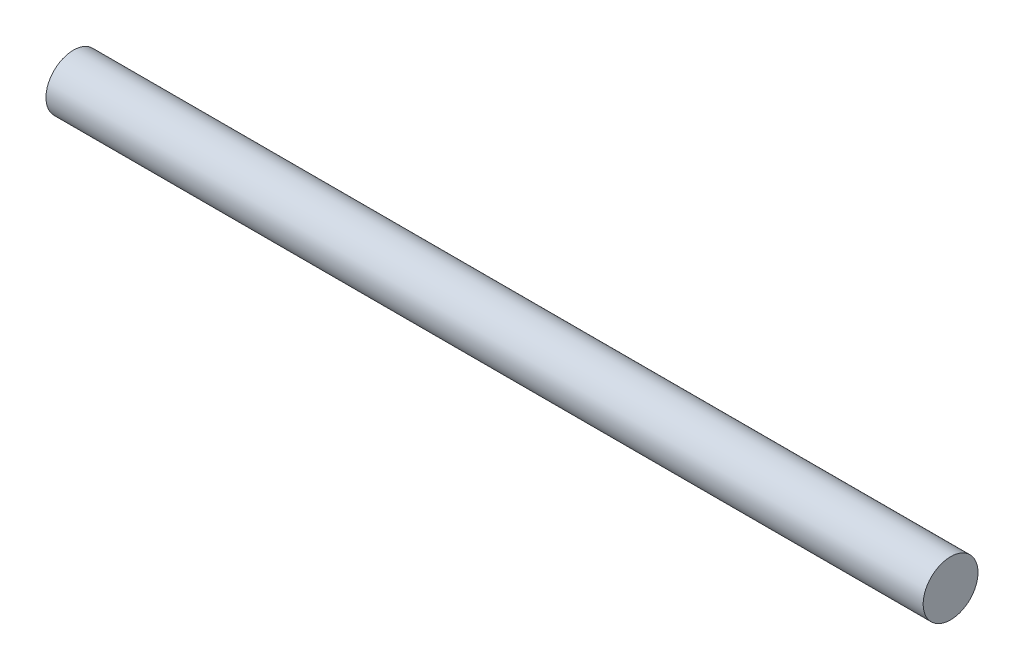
ISO-10303-21;
HEADER;
FILE_DESCRIPTION(('STEP AP214'),'2;1');
FILE_NAME('part.step','',(''),(''),'','','');
FILE_SCHEMA(('AUTOMOTIVE_DESIGN { 1 0 10303 214 1 1 1 1 }'));
ENDSEC;
DATA;
#1=APPLICATION_CONTEXT('core data for automotive mechanical design processes');
#2=APPLICATION_PROTOCOL_DEFINITION('international standard','automotive_design',2000,#1);
#3=PRODUCT_CONTEXT('',#1,'mechanical');
#4=PRODUCT('Part','Part','',(#3));
#5=PRODUCT_RELATED_PRODUCT_CATEGORY('part','',(#4));
#6=PRODUCT_DEFINITION_FORMATION('','',#4);
#7=PRODUCT_DEFINITION_CONTEXT('part definition',#1,'design');
#8=PRODUCT_DEFINITION('design','',#6,#7);
#9=PRODUCT_DEFINITION_SHAPE('','',#8);
#10=(LENGTH_UNIT() NAMED_UNIT(*) SI_UNIT(.MILLI.,.METRE.));
#11=(NAMED_UNIT(*) PLANE_ANGLE_UNIT() SI_UNIT($,.RADIAN.));
#12=(NAMED_UNIT(*) SI_UNIT($,.STERADIAN.) SOLID_ANGLE_UNIT());
#13=UNCERTAINTY_MEASURE_WITH_UNIT(LENGTH_MEASURE(1.E-05),#10,'distance_accuracy_value','');
#14=(GEOMETRIC_REPRESENTATION_CONTEXT(3) GLOBAL_UNCERTAINTY_ASSIGNED_CONTEXT((#13)) GLOBAL_UNIT_ASSIGNED_CONTEXT((#10,
#11,#12)) REPRESENTATION_CONTEXT('',''));
#15=CARTESIAN_POINT('',(0.,0.,0.));
#16=DIRECTION('',(0.,0.,1.));
#17=DIRECTION('',(1.,0.,0.));
#18=AXIS2_PLACEMENT_3D('',#15,#16,#17);
#19=CARTESIAN_POINT('',(406.4,0.,0.));
#20=DIRECTION('',(-1.,0.,0.));
#21=DIRECTION('',(0.,0.,1.));
#22=AXIS2_PLACEMENT_3D('',#19,#20,#21);
#23=CYLINDRICAL_SURFACE('',#22,12.7);
#24=CARTESIAN_POINT('',(406.4,0.,0.));
#25=DIRECTION('',(1.,0.,0.));
#26=DIRECTION('',(0.,0.,-1.));
#27=AXIS2_PLACEMENT_3D('',#24,#25,#26);
#28=CIRCLE('',#27,12.7);
#29=CARTESIAN_POINT('',(406.4,0.,-12.7));
#30=VERTEX_POINT('',#29);
#31=EDGE_CURVE('E10',#30,#30,#28,.T.);
#32=ORIENTED_EDGE('',*,*,#31,.F.);
#33=EDGE_LOOP('',(#32));
#34=FACE_BOUND('',#33,.T.);
#35=CARTESIAN_POINT('',(0.,0.,0.));
#36=DIRECTION('',(1.,0.,0.));
#37=DIRECTION('',(0.,0.,-1.));
#38=AXIS2_PLACEMENT_3D('',#35,#36,#37);
#39=CIRCLE('',#38,12.7);
#40=CARTESIAN_POINT('',(0.,0.,-12.7));
#41=VERTEX_POINT('',#40);
#42=EDGE_CURVE('E32',#41,#41,#39,.T.);
#43=ORIENTED_EDGE('',*,*,#42,.T.);
#44=EDGE_LOOP('',(#43));
#45=FACE_BOUND('',#44,.T.);
#46=ADVANCED_FACE('F29',(#34,#45),#23,.T.);
#47=CARTESIAN_POINT('',(406.4,0.,0.));
#48=DIRECTION('',(1.,0.,0.));
#49=DIRECTION('',(0.,0.,-1.));
#50=AXIS2_PLACEMENT_3D('',#47,#48,#49);
#51=PLANE('',#50);
#52=ORIENTED_EDGE('',*,*,#31,.T.);
#53=EDGE_LOOP('',(#52));
#54=FACE_BOUND('',#53,.T.);
#55=ADVANCED_FACE('F44',(#54),#51,.T.);
#56=CARTESIAN_POINT('',(0.,0.,0.));
#57=DIRECTION('',(1.,0.,0.));
#58=DIRECTION('',(0.,0.,-1.));
#59=AXIS2_PLACEMENT_3D('',#56,#57,#58);
#60=PLANE('',#59);
#61=ORIENTED_EDGE('',*,*,#42,.F.);
#62=EDGE_LOOP('',(#61));
#63=FACE_BOUND('',#62,.T.);
#64=ADVANCED_FACE('F42',(#63),#60,.F.);
#65=CLOSED_SHELL('',(#46,#55,#64));
#66=MANIFOLD_SOLID_BREP('B2',#65);
#67=ADVANCED_BREP_SHAPE_REPRESENTATION('',(#18,#66),#14);
#68=SHAPE_DEFINITION_REPRESENTATION(#9,#67);
ENDSEC;
END-ISO-10303-21;
